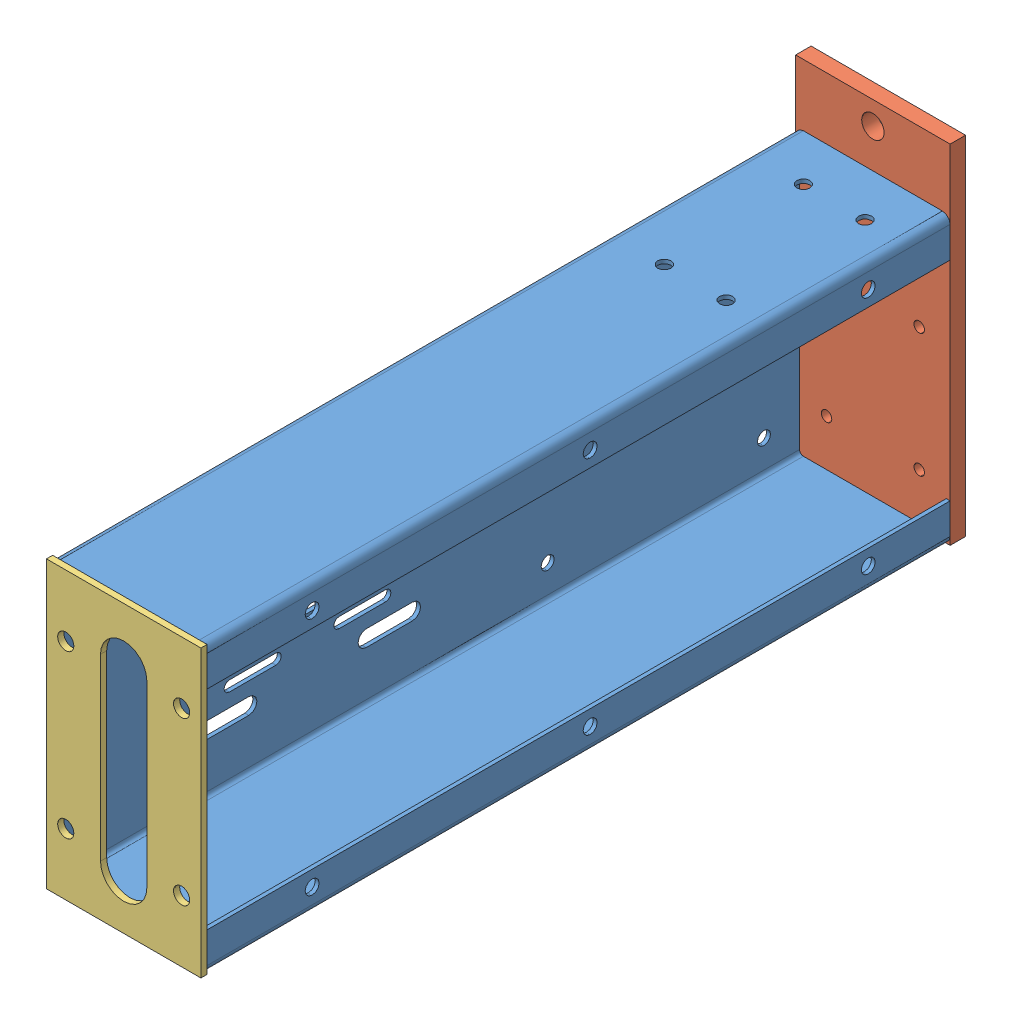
SolidWorks assembly CU030945.sldasm, configuration Défaut (file format 3400). Lengths in mm.
Overall size (100 225 495).
3 component instances, 3 part files, 6 mates.
Components (placement in the parent):
- CU030946-1: CU030946.sldprt [Défaut] at origin size (100 185 481)
- CU030943-1: CU030943.sldprt [Défaut] at (50 112.5 -10) x (0 -1 0) z (1 0 0) size (225 10 100)
- CU030947-1: CU030947.sldprt [Défaut] at (0 185 481) x (0 -1 0) z (0 0 1) size (185 100 4)
Mates (geometry in assembly coordinates):
- Coïncidente1: coincident anti-aligned: plane of CU030946-1 through (2.5 180 481) normal (0 0 1); plane of CU030947-1 through (0 185 481) normal (0 0 -1)
- Coïncidente2: coincident aligned: plane of CU030946-1 through (0 0 481) normal (-1 0 0); plane of CU030947-1 through (0 185 485) normal (-1 0 0)
- Coïncidente3: coincident aligned: plane of CU030946-1 through (100 0 481) normal (0 -1 0); plane of CU030947-1 through (100 0 485) normal (0 -1 0)
- Coïncidente4: coincident anti-aligned: plane of CU030946-1 through (2.5 5 0) normal (0 0 -1); plane of CU030943-1 through (100 0 0) normal (0 0 1)
- Coïncidente5: coincident aligned: plane of CU030946-1 through (0 0 481) normal (-1 0 0); plane of CU030943-1 through (0 0 -10) normal (-1 0 0)
- Coïncidente7: coincident aligned: plane of CU030946-1 through (100 0 481) normal (0 -1 0); plane of CU030943-1 through (100 0 -10) normal (0 -1 0)
